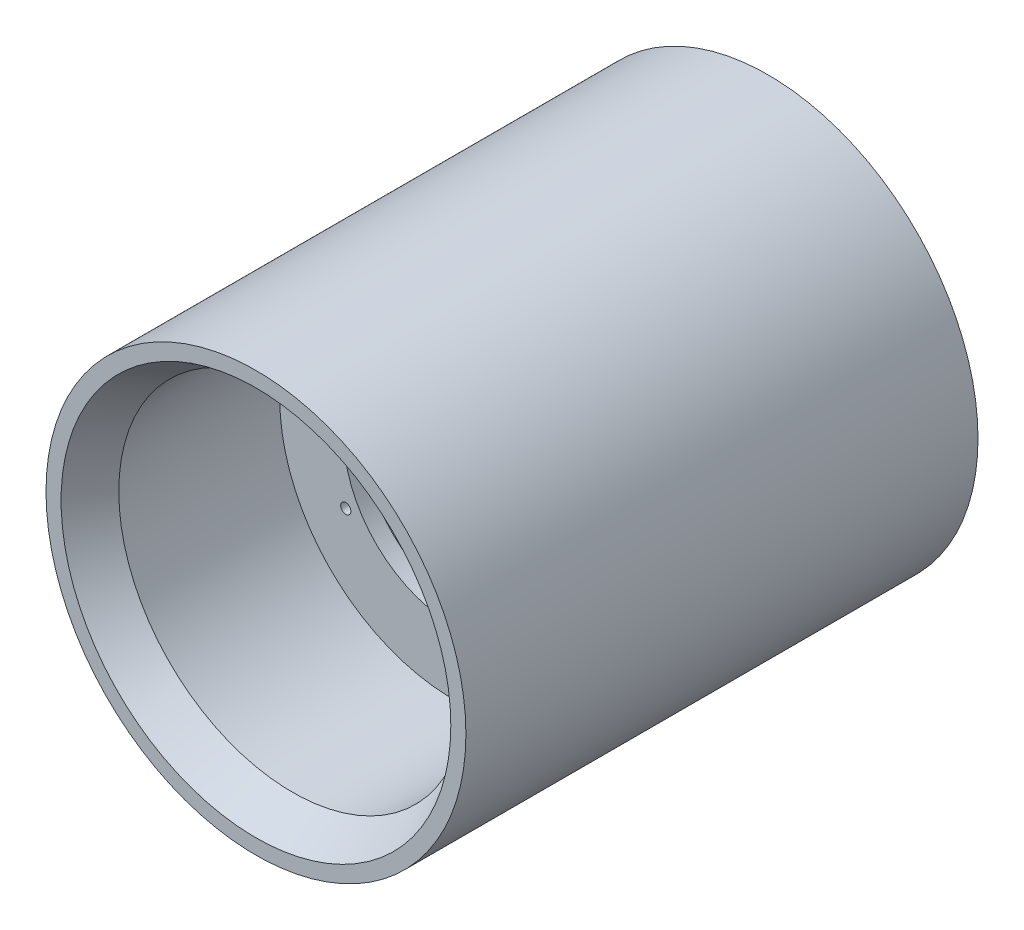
from build123d import *
from OCP.BRepFilletAPI import BRepFilletAPI_MakeChamfer

# Parameters (mm, degrees)
SKETCH1_R                 = 36.449
BOSS_EXTRUDE1_DEPTH       = 88.9
SKETCH2_R                 = 30.1625
CUT_EXTRUDE1_DEPTH        = 34.29
CUT_EXTRUDE2_START        = -35.052
SKETCH3_R                 = 30.1625
CUT_EXTRUDE2_DEPTH        = 35.052
SKETCH4_R                 = 19.05
CUT_EXTRUDE3_DEPTH        = 2.921
CUT_EXTRUDE4_START        = -3.81
SKETCH5_R                 = 19.05
CUT_EXTRUDE4_DEPTH        = 3.81
CUT_EXTRUDE5_REACH        = 74.999
SKETCH6_R                 = 15.7861
F_2_56_TAPPED_HOLE1_D     = 1.778
F_2_56_TAPPED_HOLE1_DEPTH = 5.7404
F_2_56_TAPPED_HOLE1_TIP   = 0.53416509
F_2_56_TAPPED_HOLE2_D     = 1.778
F_2_56_TAPPED_HOLE2_DEPTH = 5.7404
F_2_56_TAPPED_HOLE2_TIP   = 0.53416509
CHAMFER1_SIZE             = 6.35
CHAMFER1_SIZE2            = 3.666174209


with BuildPart() as part:
    # Sketch1 → Boss-Extrude1 (new body)
    with BuildSketch(Plane.XY):
        Circle(SKETCH1_R)
    extrude(amount=BOSS_EXTRUDE1_DEPTH)

    # Sketch2 → Cut-Extrude1 (cut)
    with BuildSketch(Plane.XY.offset(88.9)):
        Circle(SKETCH2_R)
    extrude(amount=-CUT_EXTRUDE1_DEPTH, mode=Mode.SUBTRACT)

    # Sketch3 → Cut-Extrude2 (cut)
    with BuildSketch(Plane(origin=(0, 0, 0), x_dir=(-1, 0, 0), z_dir=(0, 0, -1)).offset(CUT_EXTRUDE2_START)):
        with Locations(Location((0, 0, 0), (0, 0, 180))):
            Circle(SKETCH3_R)
    extrude(amount=CUT_EXTRUDE2_DEPTH, mode=Mode.SUBTRACT)

    # Sketch4 → Cut-Extrude3 (cut)
    with BuildSketch(Plane.XY.offset(54.61)):
        Circle(SKETCH4_R)
    extrude(amount=-CUT_EXTRUDE3_DEPTH, mode=Mode.SUBTRACT)

    # Sketch5 → Cut-Extrude4 (cut)
    with BuildSketch(Plane(origin=(0, 0, 35.052), x_dir=(-1, 0, 0), z_dir=(0, 0, -1)).offset(CUT_EXTRUDE4_START)):
        with Locations(Location((0, 0, 0), (0, 0, 180))):
            Circle(SKETCH5_R)
    extrude(amount=CUT_EXTRUDE4_DEPTH, mode=Mode.SUBTRACT)

    # Sketch6 → Cut-Extrude5 (cut, up to next)
    with BuildSketch(Plane.XY.offset(51.689), mode=Mode.PRIVATE) as cut_extrude5_sk1:
        Circle(SKETCH6_R)
    cut_extrude5_tool1 = extrude(cut_extrude5_sk1.sketch, amount=-CUT_EXTRUDE5_REACH, mode=Mode.PRIVATE) & part.part
    add(cut_extrude5_tool1.solids().sort_by_distance((0, 0, 51.689))[0], mode=Mode.SUBTRACT)

    # 2-56 Tapped Hole1
    with Locations(Plane.XY.offset(54.61)):
        with Locations((0, 21.59), (18.697488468, -10.795), (-18.697488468, -10.795)):
            Hole(F_2_56_TAPPED_HOLE1_D / 2, depth=F_2_56_TAPPED_HOLE1_DEPTH)
            with Locations((0, 0, -(F_2_56_TAPPED_HOLE1_DEPTH + F_2_56_TAPPED_HOLE1_TIP / 2))):  # 118° drill point
                Cone(0, F_2_56_TAPPED_HOLE1_D / 2, F_2_56_TAPPED_HOLE1_TIP, mode=Mode.SUBTRACT)

    # 2-56 Tapped Hole2
    with Locations(Plane(origin=(0, 0, 35.052), x_dir=(-1, 0, 0), z_dir=(0, 0, -1))):
        with Locations((0, 21.59), (18.697488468, -10.795), (-18.697488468, -10.795)):
            Hole(F_2_56_TAPPED_HOLE2_D / 2, depth=F_2_56_TAPPED_HOLE2_DEPTH)
            with Locations((0, 0, -(F_2_56_TAPPED_HOLE2_DEPTH + F_2_56_TAPPED_HOLE2_TIP / 2))):  # 118° drill point
                Cone(0, F_2_56_TAPPED_HOLE2_D / 2, F_2_56_TAPPED_HOLE2_TIP, mode=Mode.SUBTRACT)

    # Chamfer1: one chamfer whose edges measure the first distance from different faces: ONE call of the kernel's chamfer builder (chamfer() names one face for all edges)
    chamfer1_edges_1 = [part.edges().sort_by_distance(p)[0] for p in [
        (-30.1625, 0, 0),
    ]]
    chamfer1_side_1 = [part.faces().sort_by_distance(p)[0] for p in [
        (-30.1625, 0, 17.526),
    ]]
    chamfer1_edges_2 = [part.edges().sort_by_distance(p)[0] for p in [
        (-30.1625, 0, 88.9),
    ]]
    chamfer1_side_2 = [part.faces().sort_by_distance(p)[0] for p in [
        (-30.1625, 0, 71.755),
    ]]
    chamfer1 = BRepFilletAPI_MakeChamfer(part.part.solid().wrapped)
    for e in chamfer1_edges_1:
        chamfer1.Add(CHAMFER1_SIZE, CHAMFER1_SIZE2, e.wrapped, chamfer1_side_1[0].wrapped)  # the first distance lies on this face
    for e in chamfer1_edges_2:
        chamfer1.Add(CHAMFER1_SIZE, CHAMFER1_SIZE2, e.wrapped, chamfer1_side_2[0].wrapped)  # the first distance lies on this face
    add(Compound.cast(chamfer1.Shape()), mode=Mode.REPLACE)


solid = part.part
